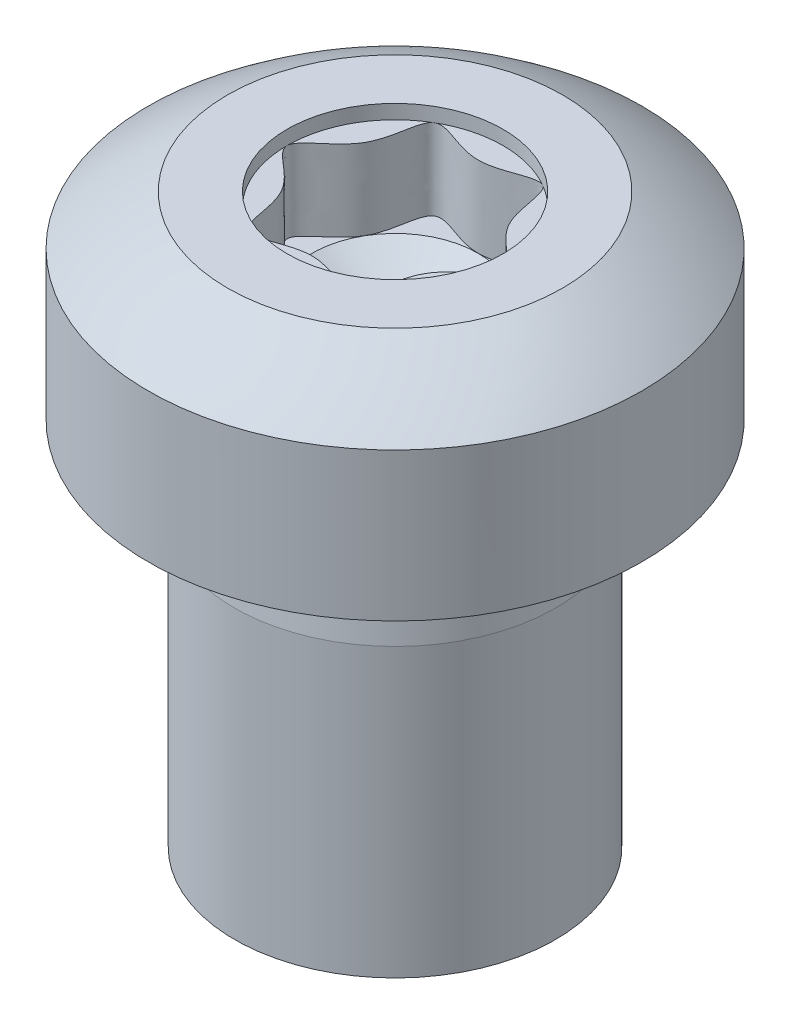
from build123d import *

# Parameters (mm, degrees)
RECESS_CUT_EXTRUDE1_DEPTH = 0.77
SKETCH7_R                 = 0.875
RECESS_CUT_EXTRUDE2_DEPTH = 0.1155


with BuildPart() as part:
    # Sketch1 → BODY (revolve)
    with BuildSketch(Plane.XY, mode=Mode.PRIVATE) as body_sk:
        Polygon((0, 0), (1.3, 0), (1.3, 3), (2, 3), (2, 4.6), (0, 4.6), align=None)
    revolve(body_sk.sketch.rotate(Axis((0, 0, 0), (0, 1, 0)), 90), axis=Axis((0, 0, 0), (0, 1, 0)))

    # Sketch2 → HEAD-CUT (revolve, cut)
    with BuildSketch(Plane.XY, mode=Mode.PRIVATE) as head_cut_sk:
        with BuildLine():
            ThreePointArc((3.2, 1.702000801), (2.2627417, 3.9647425), (0, 4.902000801))
            Line((0, 4.902000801), (0, 5.384162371))
            Line((0, 5.384162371), (3.2, 5.384162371))
            Line((3.2, 5.384162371), (3.2, 1.702000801))
        make_face()
    revolve(head_cut_sk.sketch.rotate(Axis((0, 0, 0), (0, 1, 0)), 90), axis=Axis((0, 0, 0), (0, 1, 0)), mode=Mode.SUBTRACT)

    # Sketch4 → GAP (revolve, cut)
    with BuildSketch(Plane.XY, mode=Mode.PRIVATE) as gap_sk:
        with BuildLine():
            Line((-1.3, 2.32643678), (-1.243617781, 2.9))
            ThreePointArc((-1.243617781, 2.9), (-1.256029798, 2.958896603), (-1.3, 3))
            Line((-1.3, 3), (-1.3, 2.32643678))
        make_face()
    revolve(gap_sk.sketch.rotate(Axis((0, 0, 0), (0, 1, 0)), 270), axis=Axis((0, 0, 0), (0, 1, 0)), mode=Mode.SUBTRACT)

    # Sketch5 → Recess-Cut-Extrude1 (cut)
    with BuildSketch(Plane(origin=(0, 4.6, 0), x_dir=(-1, 0, 0), z_dir=(0, 1, 0))):
        with BuildLine():
            add(Edge.make_bspline(
                [(0.4375, 0.757772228), (0.515892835, 0.712512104), (0.470357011, 0.271560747), (1.077321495, 0), (0.470357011, -0.271560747), (0.538660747, -0.932987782), (0, -0.543121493), (-0.538660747, -0.932987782), (-0.470357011, -0.271560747), (-1.077321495, 0), (-0.470357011, 0.271560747), (-0.538660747, 0.932987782), (0, 0.543121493), (0.359107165, 0.803032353), (0.4375, 0.757772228)],
                knots=[0, 0, 0, 0, 0.083333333, 0.166666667, 0.25, 0.333333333, 0.416666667, 0.5, 0.583333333, 0.666666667, 0.75, 0.833333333, 0.916666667, 1, 1, 1, 1], degree=3))
        make_face()
    extrude(amount=-RECESS_CUT_EXTRUDE1_DEPTH, mode=Mode.SUBTRACT)

    # Sketch3 → DRILL-CUT (revolve, cut)
    with BuildSketch(Plane.XY):
        Polygon((0, 3.441398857), (0.673076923, 3.83), (0, 3.83), align=None)
    revolve(axis=Axis((0, 0, 0), (0, 1, 0)), mode=Mode.SUBTRACT)

    # Sketch7 → Recess-Cut-Extrude2 (cut)
    with BuildSketch(Plane(origin=(0, 4.6, 0), x_dir=(-1, 0, 0), z_dir=(0, 1, 0))):
        with Locations(Location((0, 0, 0), (0, 0, 90))):
            Circle(SKETCH7_R)
    extrude(amount=-RECESS_CUT_EXTRUDE2_DEPTH, mode=Mode.SUBTRACT)


solid = part.part
